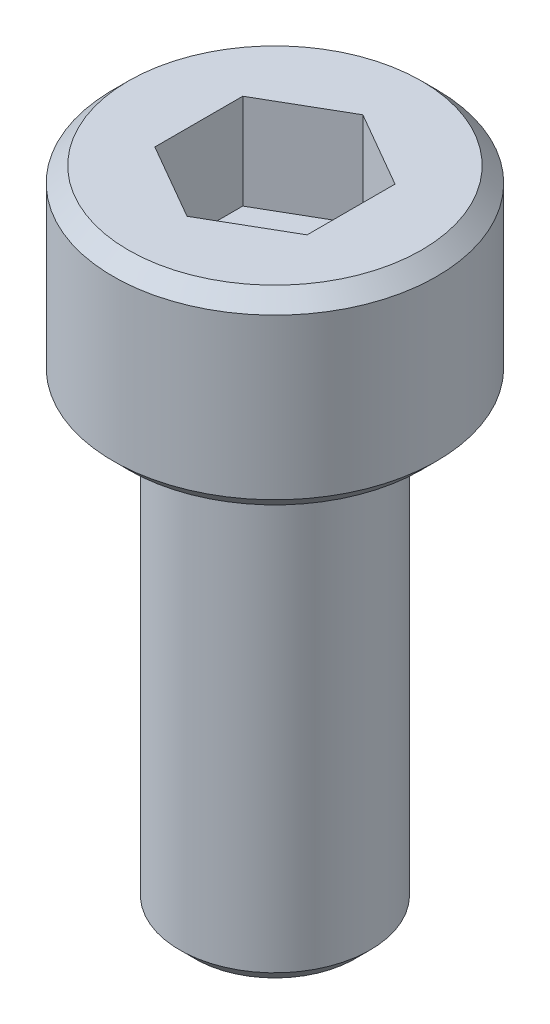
ISO-10303-21;
HEADER;
FILE_DESCRIPTION(('STEP AP214'),'2;1');
FILE_NAME('part.step','',(''),(''),'','','');
FILE_SCHEMA(('AUTOMOTIVE_DESIGN { 1 0 10303 214 1 1 1 1 }'));
ENDSEC;
DATA;
#1=APPLICATION_CONTEXT('core data for automotive mechanical design processes');
#2=APPLICATION_PROTOCOL_DEFINITION('international standard','automotive_design',2000,#1);
#3=PRODUCT_CONTEXT('',#1,'mechanical');
#4=PRODUCT('Part','Part','',(#3));
#5=PRODUCT_RELATED_PRODUCT_CATEGORY('part','',(#4));
#6=PRODUCT_DEFINITION_FORMATION('','',#4);
#7=PRODUCT_DEFINITION_CONTEXT('part definition',#1,'design');
#8=PRODUCT_DEFINITION('design','',#6,#7);
#9=PRODUCT_DEFINITION_SHAPE('','',#8);
#10=(LENGTH_UNIT() NAMED_UNIT(*) SI_UNIT(.MILLI.,.METRE.));
#11=(NAMED_UNIT(*) PLANE_ANGLE_UNIT() SI_UNIT($,.RADIAN.));
#12=(NAMED_UNIT(*) SI_UNIT($,.STERADIAN.) SOLID_ANGLE_UNIT());
#13=UNCERTAINTY_MEASURE_WITH_UNIT(LENGTH_MEASURE(1.E-05),#10,'distance_accuracy_value','');
#14=(GEOMETRIC_REPRESENTATION_CONTEXT(3) GLOBAL_UNCERTAINTY_ASSIGNED_CONTEXT((#13)) GLOBAL_UNIT_ASSIGNED_CONTEXT((#10,
#11,#12)) REPRESENTATION_CONTEXT('',''));
#15=CARTESIAN_POINT('',(0.,0.,0.));
#16=DIRECTION('',(0.,0.,1.));
#17=DIRECTION('',(1.,0.,0.));
#18=AXIS2_PLACEMENT_3D('',#15,#16,#17);
#19=CARTESIAN_POINT('',(4.25000000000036,17.0000000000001,0.));
#20=DIRECTION('',(0.,0.999999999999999,0.));
#21=DIRECTION('',(0.,0.,1.));
#22=AXIS2_PLACEMENT_3D('',#19,#20,#21);
#23=PLANE('',#22);
#24=DIRECTION('',(0.866025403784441,0.,-0.5));
#25=VECTOR('',#24,1.);
#26=CARTESIAN_POINT('',(2.22044604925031E-13,17.0000000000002,2.30940107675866));
#27=LINE('',#26,#25);
#28=CARTESIAN_POINT('',(2.22044604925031E-13,17.0000000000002,2.30940107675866));
#29=VERTEX_POINT('',#28);
#30=CARTESIAN_POINT('',(2.00000000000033,17.0000000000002,1.15470053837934));
#31=VERTEX_POINT('',#30);
#32=EDGE_CURVE('E52',#29,#31,#27,.T.);
#33=ORIENTED_EDGE('',*,*,#32,.F.);
#34=DIRECTION('',(0.866025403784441,0.,0.5));
#35=VECTOR('',#34,1.);
#36=CARTESIAN_POINT('',(-1.99999999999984,17.,1.15470053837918));
#37=LINE('',#36,#35);
#38=CARTESIAN_POINT('',(-1.99999999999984,17.,1.15470053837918));
#39=VERTEX_POINT('',#38);
#40=EDGE_CURVE('E121',#39,#29,#37,.T.);
#41=ORIENTED_EDGE('',*,*,#40,.F.);
#42=DIRECTION('',(0.,0.,1.));
#43=VECTOR('',#42,1.);
#44=CARTESIAN_POINT('',(-1.99999999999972,17.0000000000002,-1.15470053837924));
#45=LINE('',#44,#43);
#46=CARTESIAN_POINT('',(-1.99999999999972,17.0000000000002,-1.15470053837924));
#47=VERTEX_POINT('',#46);
#48=EDGE_CURVE('E115',#47,#39,#45,.T.);
#49=ORIENTED_EDGE('',*,*,#48,.F.);
#50=DIRECTION('',(-0.866025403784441,0.,0.5));
#51=VECTOR('',#50,1.);
#52=CARTESIAN_POINT('',(1.66533453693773E-13,17.0000000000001,-2.30940107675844));
#53=LINE('',#52,#51);
#54=CARTESIAN_POINT('',(1.66533453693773E-13,17.0000000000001,-2.30940107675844));
#55=VERTEX_POINT('',#54);
#56=EDGE_CURVE('E113',#55,#47,#53,.T.);
#57=ORIENTED_EDGE('',*,*,#56,.F.);
#58=DIRECTION('',(-0.866025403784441,0.,-0.5));
#59=VECTOR('',#58,1.);
#60=CARTESIAN_POINT('',(2.00000000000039,17.0000000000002,-1.15470053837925));
#61=LINE('',#60,#59);
#62=CARTESIAN_POINT('',(2.00000000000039,17.0000000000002,-1.15470053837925));
#63=VERTEX_POINT('',#62);
#64=EDGE_CURVE('E95',#63,#55,#61,.T.);
#65=ORIENTED_EDGE('',*,*,#64,.F.);
#66=DIRECTION('',(0.,0.,-1.));
#67=VECTOR('',#66,1.);
#68=CARTESIAN_POINT('',(2.00000000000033,17.0000000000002,1.15470053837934));
#69=LINE('',#68,#67);
#70=EDGE_CURVE('E106',#31,#63,#69,.T.);
#71=ORIENTED_EDGE('',*,*,#70,.F.);
#72=EDGE_LOOP('',(#33,#41,#49,#57,#65,#71));
#73=FACE_BOUND('',#72,.T.);
#74=CARTESIAN_POINT('',(1.66533453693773E-13,17.0000000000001,0.));
#75=DIRECTION('',(0.,0.999999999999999,0.));
#76=DIRECTION('',(0.,0.,1.));
#77=AXIS2_PLACEMENT_3D('',#74,#75,#76);
#78=CIRCLE('',#77,3.85);
#79=CARTESIAN_POINT('',(3.33752470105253E-13,17.0000000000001,-3.85000000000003));
#80=VERTEX_POINT('',#79);
#81=EDGE_CURVE('E154',#80,#80,#78,.T.);
#82=ORIENTED_EDGE('',*,*,#81,.T.);
#83=EDGE_LOOP('',(#82));
#84=FACE_BOUND('',#83,.T.);
#85=ADVANCED_FACE('F38',(#73,#84),#23,.T.);
#86=CARTESIAN_POINT('',(2.77555756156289E-13,1.11022302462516E-13,1.38777878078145E-13));
#87=DIRECTION('',(0.,-0.999999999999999,0.));
#88=DIRECTION('',(0.,0.,-1.));
#89=AXIS2_PLACEMENT_3D('',#86,#87,#88);
#90=CYLINDRICAL_SURFACE('',#89,4.25);
#91=CARTESIAN_POINT('',(3.33066907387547E-13,16.6000000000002,0.));
#92=DIRECTION('',(0.,0.999999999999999,0.));
#93=DIRECTION('',(0.,0.,1.));
#94=AXIS2_PLACEMENT_3D('',#91,#92,#93);
#95=CIRCLE('',#94,4.25);
#96=CARTESIAN_POINT('',(2.80106493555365E-13,16.6000000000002,-4.24999999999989));
#97=VERTEX_POINT('',#96);
#98=EDGE_CURVE('E151',#97,#97,#95,.F.);
#99=CARTESIAN_POINT('',(2.22044604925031E-13,12.4000000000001,0.));
#100=DIRECTION('',(0.,-0.999999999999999,0.));
#101=DIRECTION('',(0.,0.,-1.));
#102=AXIS2_PLACEMENT_3D('',#99,#100,#101);
#103=CIRCLE('',#102,4.25);
#104=CARTESIAN_POINT('',(2.79640199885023E-13,12.4000000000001,-4.24999999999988));
#105=VERTEX_POINT('',#104);
#106=EDGE_CURVE('E148',#105,#105,#103,.F.);
#107=CARTESIAN_POINT('',(2.80106493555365E-13,16.6000000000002,-4.24999999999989));
#108=CARTESIAN_POINT('',(2.80101636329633E-13,16.5562500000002,-4.24999999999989));
#109=CARTESIAN_POINT('',(2.800967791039E-13,16.5125000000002,-4.24999999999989));
#110=CARTESIAN_POINT('',(2.80087064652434E-13,16.4250000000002,-4.24999999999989));
#111=CARTESIAN_POINT('',(2.80082207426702E-13,16.3812500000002,-4.24999999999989));
#112=CARTESIAN_POINT('',(2.80072492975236E-13,16.2937500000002,-4.24999999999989));
#113=CARTESIAN_POINT('',(2.80067635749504E-13,16.2500000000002,-4.24999999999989));
#114=CARTESIAN_POINT('',(2.80057921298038E-13,16.1625000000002,-4.24999999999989));
#115=CARTESIAN_POINT('',(2.80053064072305E-13,16.1187500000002,-4.24999999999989));
#116=CARTESIAN_POINT('',(2.8004334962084E-13,16.0312500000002,-4.24999999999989));
#117=CARTESIAN_POINT('',(2.80038492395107E-13,15.9875000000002,-4.24999999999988));
#118=CARTESIAN_POINT('',(2.80028777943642E-13,15.9000000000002,-4.24999999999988));
#119=CARTESIAN_POINT('',(2.80023920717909E-13,15.8562500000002,-4.24999999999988));
#120=CARTESIAN_POINT('',(2.80014206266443E-13,15.7687500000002,-4.24999999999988));
#121=CARTESIAN_POINT('',(2.80009349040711E-13,15.7250000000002,-4.24999999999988));
#122=CARTESIAN_POINT('',(2.79999634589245E-13,15.6375000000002,-4.24999999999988));
#123=CARTESIAN_POINT('',(2.79994777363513E-13,15.5937500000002,-4.24999999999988));
#124=CARTESIAN_POINT('',(2.79985062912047E-13,15.5062500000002,-4.24999999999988));
#125=CARTESIAN_POINT('',(2.79980205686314E-13,15.4625000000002,-4.24999999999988));
#126=CARTESIAN_POINT('',(2.79970491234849E-13,15.3750000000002,-4.24999999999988));
#127=CARTESIAN_POINT('',(2.79965634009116E-13,15.3312500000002,-4.24999999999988));
#128=CARTESIAN_POINT('',(2.79955919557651E-13,15.2437500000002,-4.24999999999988));
#129=CARTESIAN_POINT('',(2.79951062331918E-13,15.2000000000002,-4.24999999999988));
#130=CARTESIAN_POINT('',(2.79941347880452E-13,15.1125000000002,-4.24999999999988));
#131=CARTESIAN_POINT('',(2.7993649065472E-13,15.0687500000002,-4.24999999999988));
#132=CARTESIAN_POINT('',(2.79926776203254E-13,14.9812500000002,-4.24999999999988));
#133=CARTESIAN_POINT('',(2.79921918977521E-13,14.9375000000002,-4.24999999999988));
#134=CARTESIAN_POINT('',(2.79912204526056E-13,14.8500000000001,-4.24999999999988));
#135=CARTESIAN_POINT('',(2.79907347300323E-13,14.8062500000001,-4.24999999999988));
#136=CARTESIAN_POINT('',(2.79897632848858E-13,14.7187500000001,-4.24999999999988));
#137=CARTESIAN_POINT('',(2.79892775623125E-13,14.6750000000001,-4.24999999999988));
#138=CARTESIAN_POINT('',(2.7988306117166E-13,14.5875000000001,-4.24999999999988));
#139=CARTESIAN_POINT('',(2.79878203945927E-13,14.5437500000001,-4.24999999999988));
#140=CARTESIAN_POINT('',(2.79868489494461E-13,14.4562500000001,-4.24999999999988));
#141=CARTESIAN_POINT('',(2.79863632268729E-13,14.4125000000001,-4.24999999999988));
#142=CARTESIAN_POINT('',(2.79853917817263E-13,14.3250000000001,-4.24999999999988));
#143=CARTESIAN_POINT('',(2.7984906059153E-13,14.2812500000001,-4.24999999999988));
#144=CARTESIAN_POINT('',(2.79839346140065E-13,14.1937500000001,-4.24999999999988));
#145=CARTESIAN_POINT('',(2.79834488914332E-13,14.1500000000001,-4.24999999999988));
#146=CARTESIAN_POINT('',(2.79824774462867E-13,14.0625000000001,-4.24999999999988));
#147=CARTESIAN_POINT('',(2.79819917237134E-13,14.0187500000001,-4.24999999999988));
#148=CARTESIAN_POINT('',(2.79810202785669E-13,13.9312500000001,-4.24999999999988));
#149=CARTESIAN_POINT('',(2.79805345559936E-13,13.8875000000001,-4.24999999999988));
#150=CARTESIAN_POINT('',(2.7979563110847E-13,13.8000000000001,-4.24999999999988));
#151=CARTESIAN_POINT('',(2.79790773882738E-13,13.7562500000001,-4.24999999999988));
#152=CARTESIAN_POINT('',(2.79781059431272E-13,13.6687500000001,-4.24999999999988));
#153=CARTESIAN_POINT('',(2.79776202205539E-13,13.6250000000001,-4.24999999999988));
#154=CARTESIAN_POINT('',(2.79766487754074E-13,13.5375000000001,-4.24999999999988));
#155=CARTESIAN_POINT('',(2.79761630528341E-13,13.4937500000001,-4.24999999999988));
#156=CARTESIAN_POINT('',(2.79751916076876E-13,13.4062500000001,-4.24999999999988));
#157=CARTESIAN_POINT('',(2.79747058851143E-13,13.3625000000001,-4.24999999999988));
#158=CARTESIAN_POINT('',(2.79737344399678E-13,13.2750000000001,-4.24999999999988));
#159=CARTESIAN_POINT('',(2.79732487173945E-13,13.2312500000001,-4.24999999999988));
#160=CARTESIAN_POINT('',(2.79722772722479E-13,13.1437500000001,-4.24999999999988));
#161=CARTESIAN_POINT('',(2.79717915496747E-13,13.1000000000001,-4.24999999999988));
#162=CARTESIAN_POINT('',(2.79708201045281E-13,13.0125000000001,-4.24999999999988));
#163=CARTESIAN_POINT('',(2.79703343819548E-13,12.9687500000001,-4.24999999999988));
#164=CARTESIAN_POINT('',(2.79693629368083E-13,12.8812500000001,-4.24999999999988));
#165=CARTESIAN_POINT('',(2.7968877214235E-13,12.8375000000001,-4.24999999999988));
#166=CARTESIAN_POINT('',(2.79679057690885E-13,12.7500000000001,-4.24999999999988));
#167=CARTESIAN_POINT('',(2.79674200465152E-13,12.7062500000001,-4.24999999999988));
#168=CARTESIAN_POINT('',(2.79664486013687E-13,12.6187500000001,-4.24999999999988));
#169=CARTESIAN_POINT('',(2.79659628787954E-13,12.5750000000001,-4.24999999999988));
#170=CARTESIAN_POINT('',(2.79649914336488E-13,12.4875000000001,-4.24999999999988));
#171=CARTESIAN_POINT('',(2.79645057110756E-13,12.4437500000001,-4.24999999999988));
#172=CARTESIAN_POINT('',(2.79640199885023E-13,12.4000000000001,-4.24999999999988));
#173=B_SPLINE_CURVE_WITH_KNOTS('',3,(#107,#108,#109,#110,#111,#112,#113,#114,#115,#116,#117,
#118,#119,#120,#121,#122,#123,#124,#125,#126,#127,#128,#129,#130,#131,#132,#133,#134,#135,#136,
#137,#138,#139,#140,#141,#142,#143,#144,#145,#146,#147,#148,#149,#150,#151,#152,#153,#154,#155,
#156,#157,#158,#159,#160,#161,#162,#163,#164,#165,#166,#167,#168,#169,#170,#171,#172),
.UNSPECIFIED.,.F.,.F.,(4,2,2,2,2,2,2,2,2,2,2,2,2,2,2,2,2,2,2,2,2,2,2,2,2,2,2,2,2,2,2,2,4),(0.,
0.131250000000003,0.262500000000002,0.393750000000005,0.525000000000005,0.656250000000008,
0.787500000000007,0.91875000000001,1.05000000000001,1.18125000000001,1.31250000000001,
1.44375000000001,1.57500000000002,1.70625000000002,1.83750000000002,1.96875000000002,
2.10000000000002,2.23125000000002,2.36250000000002,2.49375000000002,2.62500000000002,
2.75625000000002,2.88750000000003,3.01875000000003,3.15000000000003,3.28125000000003,
3.41250000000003,3.54375000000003,3.67500000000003,3.80625000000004,3.93750000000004,
4.06875000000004,4.20000000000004),.UNSPECIFIED.);
#174=EDGE_CURVE('BSEAM181',#97,#105,#173,.T.);
#175=ORIENTED_EDGE('',*,*,#98,.T.);
#176=ORIENTED_EDGE('',*,*,#106,.T.);
#177=ORIENTED_EDGE('',*,*,#174,.T.);
#178=ORIENTED_EDGE('',*,*,#174,.F.);
#179=EDGE_LOOP('',(#175,#177,#176,#178));
#180=FACE_BOUND('',#179,.T.);
#181=ADVANCED_FACE('F181',(#180),#90,.T.);
#182=CARTESIAN_POINT('',(2.50000000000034,12.0000000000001,2.08166817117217E-13));
#183=DIRECTION('',(0.,-0.999999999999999,0.));
#184=DIRECTION('',(0.,0.,-1.));
#185=AXIS2_PLACEMENT_3D('',#182,#183,#184);
#186=PLANE('',#185);
#187=CARTESIAN_POINT('',(2.22044604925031E-13,12.0000000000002,0.));
#188=DIRECTION('',(0.,-0.999999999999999,0.));
#189=DIRECTION('',(0.,0.,-1.));
#190=AXIS2_PLACEMENT_3D('',#187,#188,#189);
#191=CIRCLE('',#190,3.85);
#192=CARTESIAN_POINT('',(2.22685758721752E-13,12.0000000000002,-3.85000000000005));
#193=VERTEX_POINT('',#192);
#194=EDGE_CURVE('E157',#193,#193,#191,.T.);
#195=ORIENTED_EDGE('',*,*,#194,.T.);
#196=EDGE_LOOP('',(#195));
#197=FACE_BOUND('',#196,.T.);
#198=CARTESIAN_POINT('',(2.22044604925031E-13,12.0000000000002,0.));
#199=DIRECTION('',(0.,-0.999999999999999,0.));
#200=DIRECTION('',(0.,0.,-1.));
#201=AXIS2_PLACEMENT_3D('',#198,#199,#200);
#202=CIRCLE('',#201,2.5);
#203=CARTESIAN_POINT('',(2.79304357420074E-13,12.0000000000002,-2.49999999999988));
#204=VERTEX_POINT('',#203);
#205=EDGE_CURVE('E139',#204,#204,#202,.T.);
#206=ORIENTED_EDGE('',*,*,#205,.F.);
#207=EDGE_LOOP('',(#206));
#208=FACE_BOUND('',#207,.T.);
#209=ADVANCED_FACE('F185',(#197,#208),#186,.T.);
#210=CARTESIAN_POINT('',(2.77555756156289E-13,1.11022302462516E-13,1.38777878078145E-13));
#211=DIRECTION('',(0.,-0.999999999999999,0.));
#212=DIRECTION('',(0.,0.,-1.));
#213=AXIS2_PLACEMENT_3D('',#210,#211,#212);
#214=CYLINDRICAL_SURFACE('',#213,2.5);
#215=CARTESIAN_POINT('',(2.22044604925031E-13,0.400000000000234,0.));
#216=DIRECTION('',(0.,-0.999999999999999,0.));
#217=DIRECTION('',(0.,0.,-1.));
#218=AXIS2_PLACEMENT_3D('',#215,#216,#217);
#219=CIRCLE('',#218,2.5);
#220=CARTESIAN_POINT('',(2.78016498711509E-13,0.400000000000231,-2.49999999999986));
#221=VERTEX_POINT('',#220);
#222=EDGE_CURVE('E11',#221,#221,#219,.F.);
#223=CARTESIAN_POINT('',(2.78016498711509E-13,0.400000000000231,-2.49999999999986));
#224=CARTESIAN_POINT('',(2.78029913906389E-13,0.520833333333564,-2.49999999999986));
#225=CARTESIAN_POINT('',(2.7804332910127E-13,0.641666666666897,-2.49999999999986));
#226=CARTESIAN_POINT('',(2.78070159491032E-13,0.883333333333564,-2.49999999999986));
#227=CARTESIAN_POINT('',(2.78083574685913E-13,1.0041666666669,-2.49999999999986));
#228=CARTESIAN_POINT('',(2.78110405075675E-13,1.24583333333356,-2.49999999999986));
#229=CARTESIAN_POINT('',(2.78123820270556E-13,1.3666666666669,-2.49999999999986));
#230=CARTESIAN_POINT('',(2.78150650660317E-13,1.60833333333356,-2.49999999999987));
#231=CARTESIAN_POINT('',(2.78164065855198E-13,1.7291666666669,-2.49999999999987));
#232=CARTESIAN_POINT('',(2.7819089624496E-13,1.97083333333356,-2.49999999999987));
#233=CARTESIAN_POINT('',(2.78204311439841E-13,2.0916666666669,-2.49999999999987));
#234=CARTESIAN_POINT('',(2.78231141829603E-13,2.33333333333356,-2.49999999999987));
#235=CARTESIAN_POINT('',(2.78244557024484E-13,2.4541666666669,-2.49999999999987));
#236=CARTESIAN_POINT('',(2.78271387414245E-13,2.69583333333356,-2.49999999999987));
#237=CARTESIAN_POINT('',(2.78284802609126E-13,2.8166666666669,-2.49999999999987));
#238=CARTESIAN_POINT('',(2.78311632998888E-13,3.05833333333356,-2.49999999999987));
#239=CARTESIAN_POINT('',(2.78325048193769E-13,3.1791666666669,-2.49999999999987));
#240=CARTESIAN_POINT('',(2.78351878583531E-13,3.42083333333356,-2.49999999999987));
#241=CARTESIAN_POINT('',(2.78365293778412E-13,3.5416666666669,-2.49999999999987));
#242=CARTESIAN_POINT('',(2.78392124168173E-13,3.78333333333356,-2.49999999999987));
#243=CARTESIAN_POINT('',(2.78405539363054E-13,3.9041666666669,-2.49999999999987));
#244=CARTESIAN_POINT('',(2.78432369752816E-13,4.14583333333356,-2.49999999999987));
#245=CARTESIAN_POINT('',(2.78445784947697E-13,4.2666666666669,-2.49999999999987));
#246=CARTESIAN_POINT('',(2.78472615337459E-13,4.50833333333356,-2.49999999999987));
#247=CARTESIAN_POINT('',(2.7848603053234E-13,4.6291666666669,-2.49999999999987));
#248=CARTESIAN_POINT('',(2.78512860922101E-13,4.87083333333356,-2.49999999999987));
#249=CARTESIAN_POINT('',(2.78526276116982E-13,4.9916666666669,-2.49999999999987));
#250=CARTESIAN_POINT('',(2.78553106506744E-13,5.23333333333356,-2.49999999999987));
#251=CARTESIAN_POINT('',(2.78566521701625E-13,5.3541666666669,-2.49999999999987));
#252=CARTESIAN_POINT('',(2.78593352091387E-13,5.59583333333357,-2.49999999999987));
#253=CARTESIAN_POINT('',(2.78606767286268E-13,5.7166666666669,-2.49999999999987));
#254=CARTESIAN_POINT('',(2.78633597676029E-13,5.95833333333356,-2.49999999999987));
#255=CARTESIAN_POINT('',(2.7864701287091E-13,6.0791666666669,-2.49999999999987));
#256=CARTESIAN_POINT('',(2.78673843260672E-13,6.32083333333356,-2.49999999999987));
#257=CARTESIAN_POINT('',(2.78687258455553E-13,6.4416666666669,-2.49999999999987));
#258=CARTESIAN_POINT('',(2.78714088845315E-13,6.68333333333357,-2.49999999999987));
#259=CARTESIAN_POINT('',(2.78727504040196E-13,6.8041666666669,-2.49999999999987));
#260=CARTESIAN_POINT('',(2.78754334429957E-13,7.04583333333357,-2.49999999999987));
#261=CARTESIAN_POINT('',(2.78767749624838E-13,7.1666666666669,-2.49999999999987));
#262=CARTESIAN_POINT('',(2.787945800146E-13,7.40833333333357,-2.49999999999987));
#263=CARTESIAN_POINT('',(2.78807995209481E-13,7.5291666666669,-2.49999999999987));
#264=CARTESIAN_POINT('',(2.78834825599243E-13,7.77083333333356,-2.49999999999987));
#265=CARTESIAN_POINT('',(2.78848240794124E-13,7.8916666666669,-2.49999999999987));
#266=CARTESIAN_POINT('',(2.78875071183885E-13,8.13333333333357,-2.49999999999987));
#267=CARTESIAN_POINT('',(2.78888486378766E-13,8.2541666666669,-2.49999999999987));
#268=CARTESIAN_POINT('',(2.78915316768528E-13,8.49583333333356,-2.49999999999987));
#269=CARTESIAN_POINT('',(2.78928731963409E-13,8.6166666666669,-2.49999999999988));
#270=CARTESIAN_POINT('',(2.78955562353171E-13,8.85833333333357,-2.49999999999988));
#271=CARTESIAN_POINT('',(2.78968977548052E-13,8.9791666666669,-2.49999999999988));
#272=CARTESIAN_POINT('',(2.78995807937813E-13,9.22083333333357,-2.49999999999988));
#273=CARTESIAN_POINT('',(2.79009223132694E-13,9.3416666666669,-2.49999999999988));
#274=CARTESIAN_POINT('',(2.79036053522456E-13,9.58333333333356,-2.49999999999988));
#275=CARTESIAN_POINT('',(2.79049468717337E-13,9.7041666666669,-2.49999999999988));
#276=CARTESIAN_POINT('',(2.79076299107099E-13,9.94583333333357,-2.49999999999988));
#277=CARTESIAN_POINT('',(2.7908971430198E-13,10.0666666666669,-2.49999999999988));
#278=CARTESIAN_POINT('',(2.79116544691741E-13,10.3083333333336,-2.49999999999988));
#279=CARTESIAN_POINT('',(2.79129959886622E-13,10.4291666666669,-2.49999999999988));
#280=CARTESIAN_POINT('',(2.79156790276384E-13,10.6708333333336,-2.49999999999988));
#281=CARTESIAN_POINT('',(2.79170205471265E-13,10.7916666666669,-2.49999999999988));
#282=CARTESIAN_POINT('',(2.79197035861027E-13,11.0333333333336,-2.49999999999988));
#283=CARTESIAN_POINT('',(2.79210451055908E-13,11.1541666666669,-2.49999999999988));
#284=CARTESIAN_POINT('',(2.79237281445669E-13,11.3958333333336,-2.49999999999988));
#285=CARTESIAN_POINT('',(2.7925069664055E-13,11.5166666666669,-2.49999999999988));
#286=CARTESIAN_POINT('',(2.79277527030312E-13,11.7583333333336,-2.49999999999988));
#287=CARTESIAN_POINT('',(2.79290942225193E-13,11.8791666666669,-2.49999999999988));
#288=CARTESIAN_POINT('',(2.79304357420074E-13,12.0000000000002,-2.49999999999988));
#289=B_SPLINE_CURVE_WITH_KNOTS('',3,(#223,#224,#225,#226,#227,#228,#229,#230,#231,#232,#233,
#234,#235,#236,#237,#238,#239,#240,#241,#242,#243,#244,#245,#246,#247,#248,#249,#250,#251,#252,
#253,#254,#255,#256,#257,#258,#259,#260,#261,#262,#263,#264,#265,#266,#267,#268,#269,#270,#271,
#272,#273,#274,#275,#276,#277,#278,#279,#280,#281,#282,#283,#284,#285,#286,#287,#288),
.UNSPECIFIED.,.F.,.F.,(4,2,2,2,2,2,2,2,2,2,2,2,2,2,2,2,2,2,2,2,2,2,2,2,2,2,2,2,2,2,2,2,4),(0.,
0.3625,0.725,1.0875,1.45,1.8125,2.175,2.5375,2.9,3.2625,3.625,3.9875,4.35,4.7125,5.075,5.4375,
5.8,6.1625,6.525,6.8875,7.25,7.6125,7.975,8.3375,8.7,9.0625,9.425,9.7875,10.15,10.5125,10.875,
11.2375,11.6),.UNSPECIFIED.);
#290=EDGE_CURVE('BSEAM190',#221,#204,#289,.T.);
#291=ORIENTED_EDGE('',*,*,#222,.T.);
#292=ORIENTED_EDGE('',*,*,#205,.T.);
#293=ORIENTED_EDGE('',*,*,#290,.T.);
#294=ORIENTED_EDGE('',*,*,#290,.F.);
#295=EDGE_LOOP('',(#291,#293,#292,#294));
#296=FACE_BOUND('',#295,.T.);
#297=ADVANCED_FACE('F190',(#296),#214,.T.);
#298=CARTESIAN_POINT('',(2.77555756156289E-13,1.11022302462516E-13,1.38777878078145E-13));
#299=DIRECTION('',(0.,-0.999999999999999,0.));
#300=DIRECTION('',(0.,0.,-1.));
#301=AXIS2_PLACEMENT_3D('',#298,#299,#300);
#302=PLANE('',#301);
#303=CARTESIAN_POINT('',(2.77555756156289E-13,1.11022302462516E-13,1.38777878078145E-13));
#304=DIRECTION('',(0.,-0.999999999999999,0.));
#305=DIRECTION('',(0.,0.,-1.));
#306=AXIS2_PLACEMENT_3D('',#303,#304,#305);
#307=CIRCLE('',#306,2.1);
#308=CARTESIAN_POINT('',(2.77905476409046E-13,1.14053211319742E-13,-2.09999999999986));
#309=VERTEX_POINT('',#308);
#310=EDGE_CURVE('E45',#309,#309,#307,.T.);
#311=ORIENTED_EDGE('',*,*,#310,.T.);
#312=EDGE_LOOP('',(#311));
#313=FACE_BOUND('',#312,.T.);
#314=ADVANCED_FACE('F162',(#313),#302,.T.);
#315=CARTESIAN_POINT('',(3.33066907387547E-13,16.6000000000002,0.));
#316=DIRECTION('',(0.,-0.999999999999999,0.));
#317=DIRECTION('',(0.,0.,-1.));
#318=AXIS2_PLACEMENT_3D('',#315,#316,#317);
#319=CONICAL_SURFACE('',#318,4.25,0.785398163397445);
#320=CARTESIAN_POINT('',(3.33752470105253E-13,17.0000000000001,-3.85000000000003));
#321=CARTESIAN_POINT('',(3.33752701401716E-13,16.9958333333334,-3.8541666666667));
#322=CARTESIAN_POINT('',(3.3375293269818E-13,16.9916666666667,-3.85833333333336));
#323=CARTESIAN_POINT('',(3.33753395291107E-13,16.9833333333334,-3.8666666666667));
#324=CARTESIAN_POINT('',(3.3375362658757E-13,16.9791666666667,-3.87083333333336));
#325=CARTESIAN_POINT('',(3.33754089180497E-13,16.9708333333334,-3.87916666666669));
#326=CARTESIAN_POINT('',(3.33754320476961E-13,16.9666666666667,-3.88333333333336));
#327=CARTESIAN_POINT('',(3.33754783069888E-13,16.9583333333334,-3.89166666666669));
#328=CARTESIAN_POINT('',(3.33755014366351E-13,16.9541666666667,-3.89583333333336));
#329=CARTESIAN_POINT('',(3.33755476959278E-13,16.9458333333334,-3.90416666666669));
#330=CARTESIAN_POINT('',(3.33755708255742E-13,16.9416666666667,-3.90833333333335));
#331=CARTESIAN_POINT('',(3.33756170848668E-13,16.9333333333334,-3.91666666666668));
#332=CARTESIAN_POINT('',(3.33756402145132E-13,16.9291666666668,-3.92083333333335));
#333=CARTESIAN_POINT('',(3.33756864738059E-13,16.9208333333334,-3.92916666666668));
#334=CARTESIAN_POINT('',(3.33757096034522E-13,16.9166666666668,-3.93333333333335));
#335=CARTESIAN_POINT('',(3.33757558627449E-13,16.9083333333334,-3.94166666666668));
#336=CARTESIAN_POINT('',(3.33757789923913E-13,16.9041666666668,-3.94583333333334));
#337=CARTESIAN_POINT('',(3.3375825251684E-13,16.8958333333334,-3.95416666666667));
#338=CARTESIAN_POINT('',(3.33758483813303E-13,16.8916666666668,-3.95833333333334));
#339=CARTESIAN_POINT('',(3.3375894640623E-13,16.8833333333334,-3.96666666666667));
#340=CARTESIAN_POINT('',(3.33759177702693E-13,16.8791666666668,-3.97083333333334));
#341=CARTESIAN_POINT('',(3.3375964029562E-13,16.8708333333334,-3.97916666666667));
#342=CARTESIAN_POINT('',(3.33759871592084E-13,16.8666666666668,-3.98333333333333));
#343=CARTESIAN_POINT('',(3.33760334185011E-13,16.8583333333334,-3.99166666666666));
#344=CARTESIAN_POINT('',(3.33760565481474E-13,16.8541666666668,-3.99583333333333));
#345=CARTESIAN_POINT('',(3.33761028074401E-13,16.8458333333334,-4.00416666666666));
#346=CARTESIAN_POINT('',(3.33761259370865E-13,16.8416666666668,-4.00833333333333));
#347=CARTESIAN_POINT('',(3.33761721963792E-13,16.8333333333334,-4.01666666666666));
#348=CARTESIAN_POINT('',(3.33761953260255E-13,16.8291666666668,-4.02083333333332));
#349=CARTESIAN_POINT('',(3.33762415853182E-13,16.8208333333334,-4.02916666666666));
#350=CARTESIAN_POINT('',(3.33762647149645E-13,16.8166666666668,-4.03333333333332));
#351=CARTESIAN_POINT('',(3.33763109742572E-13,16.8083333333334,-4.04166666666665));
#352=CARTESIAN_POINT('',(3.33763341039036E-13,16.8041666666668,-4.04583333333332));
#353=CARTESIAN_POINT('',(3.33763803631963E-13,16.7958333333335,-4.05416666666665));
#354=CARTESIAN_POINT('',(3.33764034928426E-13,16.7916666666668,-4.05833333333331));
#355=CARTESIAN_POINT('',(3.33764497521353E-13,16.7833333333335,-4.06666666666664));
#356=CARTESIAN_POINT('',(3.33764728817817E-13,16.7791666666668,-4.07083333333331));
#357=CARTESIAN_POINT('',(3.33765191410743E-13,16.7708333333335,-4.07916666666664));
#358=CARTESIAN_POINT('',(3.33765422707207E-13,16.7666666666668,-4.08333333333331));
#359=CARTESIAN_POINT('',(3.33765885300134E-13,16.7583333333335,-4.09166666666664));
#360=CARTESIAN_POINT('',(3.33766116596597E-13,16.7541666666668,-4.0958333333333));
#361=CARTESIAN_POINT('',(3.33766579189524E-13,16.7458333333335,-4.10416666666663));
#362=CARTESIAN_POINT('',(3.33766810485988E-13,16.7416666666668,-4.1083333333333));
#363=CARTESIAN_POINT('',(3.33767273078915E-13,16.7333333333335,-4.11666666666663));
#364=CARTESIAN_POINT('',(3.33767504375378E-13,16.7291666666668,-4.1208333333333));
#365=CARTESIAN_POINT('',(3.33767966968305E-13,16.7208333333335,-4.12916666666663));
#366=CARTESIAN_POINT('',(3.33768198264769E-13,16.7166666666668,-4.13333333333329));
#367=CARTESIAN_POINT('',(3.33768660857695E-13,16.7083333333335,-4.14166666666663));
#368=CARTESIAN_POINT('',(3.33768892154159E-13,16.7041666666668,-4.14583333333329));
#369=CARTESIAN_POINT('',(3.33769354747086E-13,16.6958333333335,-4.15416666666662));
#370=CARTESIAN_POINT('',(3.33769586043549E-13,16.6916666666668,-4.15833333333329));
#371=CARTESIAN_POINT('',(3.33770048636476E-13,16.6833333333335,-4.16666666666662));
#372=CARTESIAN_POINT('',(3.3377027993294E-13,16.6791666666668,-4.17083333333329));
#373=CARTESIAN_POINT('',(3.33770742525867E-13,16.6708333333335,-4.17916666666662));
#374=CARTESIAN_POINT('',(3.3377097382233E-13,16.6666666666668,-4.18333333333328));
#375=CARTESIAN_POINT('',(3.33771436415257E-13,16.6583333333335,-4.19166666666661));
#376=CARTESIAN_POINT('',(3.3377166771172E-13,16.6541666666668,-4.19583333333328));
#377=CARTESIAN_POINT('',(3.33772130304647E-13,16.6458333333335,-4.20416666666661));
#378=CARTESIAN_POINT('',(3.33772361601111E-13,16.6416666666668,-4.20833333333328));
#379=CARTESIAN_POINT('',(3.33772824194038E-13,16.6333333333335,-4.21666666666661));
#380=CARTESIAN_POINT('',(3.33773055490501E-13,16.6291666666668,-4.22083333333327));
#381=CARTESIAN_POINT('',(3.33773518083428E-13,16.6208333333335,-4.2291666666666));
#382=CARTESIAN_POINT('',(3.33773749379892E-13,16.6166666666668,-4.23333333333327));
#383=CARTESIAN_POINT('',(3.33774211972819E-13,16.6083333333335,-4.2416666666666));
#384=CARTESIAN_POINT('',(3.33774443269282E-13,16.6041666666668,-4.24583333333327));
#385=CARTESIAN_POINT('',(3.33774674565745E-13,16.6000000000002,-4.24999999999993));
#386=B_SPLINE_CURVE_WITH_KNOTS('',3,(#320,#321,#322,#323,#324,#325,#326,#327,#328,#329,#330,
#331,#332,#333,#334,#335,#336,#337,#338,#339,#340,#341,#342,#343,#344,#345,#346,#347,#348,#349,
#350,#351,#352,#353,#354,#355,#356,#357,#358,#359,#360,#361,#362,#363,#364,#365,#366,#367,#368,
#369,#370,#371,#372,#373,#374,#375,#376,#377,#378,#379,#380,#381,#382,#383,#384,#385),
.UNSPECIFIED.,.F.,.F.,(4,2,2,2,2,2,2,2,2,2,2,2,2,2,2,2,2,2,2,2,2,2,2,2,2,2,2,2,2,2,2,2,4),(0.,
0.0176776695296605,0.0353553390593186,0.0530330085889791,0.0707106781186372,0.0883883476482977,
0.106066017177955,0.123743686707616,0.141421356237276,0.159099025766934,0.176776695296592,
0.194454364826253,0.212132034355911,0.229809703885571,0.247487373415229,0.265165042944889,
0.282842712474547,0.300520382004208,0.318198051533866,0.335875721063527,0.353553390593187,
0.371231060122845,0.388908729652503,0.406586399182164,0.424264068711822,0.441941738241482,
0.45961940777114,0.4772970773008,0.494974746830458,0.512652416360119,0.530330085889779,
0.548007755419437,0.565685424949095),.UNSPECIFIED.);
#387=EDGE_CURVE('BSEAM176',#80,#97,#386,.T.);
#388=ORIENTED_EDGE('',*,*,#81,.F.);
#389=ORIENTED_EDGE('',*,*,#98,.F.);
#390=ORIENTED_EDGE('',*,*,#387,.T.);
#391=ORIENTED_EDGE('',*,*,#387,.F.);
#392=EDGE_LOOP('',(#388,#390,#389,#391));
#393=FACE_BOUND('',#392,.T.);
#394=ADVANCED_FACE('F176',(#393),#319,.T.);
#395=CARTESIAN_POINT('',(2.22044604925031E-13,12.0000000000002,0.));
#396=DIRECTION('',(0.,0.999999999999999,0.));
#397=DIRECTION('',(0.,0.,1.));
#398=AXIS2_PLACEMENT_3D('',#395,#396,#397);
#399=CONICAL_SURFACE('',#398,3.85,0.785398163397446);
#400=ORIENTED_EDGE('',*,*,#106,.F.);
#401=EDGE_LOOP('',(#400));
#402=FACE_BOUND('',#401,.T.);
#403=ORIENTED_EDGE('',*,*,#194,.F.);
#404=EDGE_LOOP('',(#403));
#405=FACE_BOUND('',#404,.T.);
#406=ADVANCED_FACE('F167',(#402,#405),#399,.T.);
#407=CARTESIAN_POINT('',(2.77555756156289E-13,1.11022302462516E-13,1.38777878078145E-13));
#408=DIRECTION('',(0.,0.999999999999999,0.));
#409=DIRECTION('',(0.,0.,1.));
#410=AXIS2_PLACEMENT_3D('',#407,#408,#409);
#411=CONICAL_SURFACE('',#410,2.1,0.785398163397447);
#412=ORIENTED_EDGE('',*,*,#222,.F.);
#413=EDGE_LOOP('',(#412));
#414=FACE_BOUND('',#413,.T.);
#415=ORIENTED_EDGE('',*,*,#310,.F.);
#416=EDGE_LOOP('',(#415));
#417=FACE_BOUND('',#416,.T.);
#418=ADVANCED_FACE('F164',(#414,#417),#411,.T.);
#419=CARTESIAN_POINT('',(3.88578058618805E-13,14.5,2.30940107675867));
#420=DIRECTION('',(0.500000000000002,0.,0.866025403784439));
#421=DIRECTION('',(0.866025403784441,0.,-0.5));
#422=AXIS2_PLACEMENT_3D('',#419,#420,#421);
#423=PLANE('',#422);
#424=ORIENTED_EDGE('',*,*,#32,.T.);
#425=DIRECTION('',(0.,0.999999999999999,0.));
#426=VECTOR('',#425,1.);
#427=CARTESIAN_POINT('',(2.00000000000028,14.5,1.15470053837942));
#428=LINE('',#427,#426);
#429=CARTESIAN_POINT('',(2.00000000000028,14.5,1.15470053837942));
#430=VERTEX_POINT('',#429);
#431=EDGE_CURVE('E103',#430,#31,#428,.T.);
#432=ORIENTED_EDGE('',*,*,#431,.F.);
#433=DIRECTION('',(0.866025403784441,0.,-0.5));
#434=VECTOR('',#433,1.);
#435=CARTESIAN_POINT('',(3.88578058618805E-13,14.5,2.30940107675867));
#436=LINE('',#435,#434);
#437=CARTESIAN_POINT('',(3.88578058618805E-13,14.5,2.30940107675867));
#438=VERTEX_POINT('',#437);
#439=EDGE_CURVE('E123',#438,#430,#436,.T.);
#440=ORIENTED_EDGE('',*,*,#439,.F.);
#441=DIRECTION('',(0.,0.999999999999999,0.));
#442=VECTOR('',#441,1.);
#443=CARTESIAN_POINT('',(3.88578058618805E-13,14.5,2.30940107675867));
#444=LINE('',#443,#442);
#445=EDGE_CURVE('E59',#438,#29,#444,.T.);
#446=ORIENTED_EDGE('',*,*,#445,.T.);
#447=EDGE_LOOP('',(#424,#432,#440,#446));
#448=FACE_BOUND('',#447,.T.);
#449=ADVANCED_FACE('F166',(#448),#423,.F.);
#450=CARTESIAN_POINT('',(-1.99999999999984,14.5000000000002,1.15470053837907));
#451=DIRECTION('',(-0.500000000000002,0.,0.866025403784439));
#452=DIRECTION('',(0.866025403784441,0.,0.5));
#453=AXIS2_PLACEMENT_3D('',#450,#451,#452);
#454=PLANE('',#453);
#455=ORIENTED_EDGE('',*,*,#40,.T.);
#456=ORIENTED_EDGE('',*,*,#445,.F.);
#457=DIRECTION('',(0.866025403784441,0.,0.5));
#458=VECTOR('',#457,1.);
#459=CARTESIAN_POINT('',(-1.99999999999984,14.5000000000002,1.15470053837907));
#460=LINE('',#459,#458);
#461=CARTESIAN_POINT('',(-1.99999999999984,14.5000000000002,1.15470053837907));
#462=VERTEX_POINT('',#461);
#463=EDGE_CURVE('E135',#462,#438,#460,.T.);
#464=ORIENTED_EDGE('',*,*,#463,.F.);
#465=DIRECTION('',(0.,0.999999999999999,0.));
#466=VECTOR('',#465,1.);
#467=CARTESIAN_POINT('',(-1.99999999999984,14.5000000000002,1.15470053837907));
#468=LINE('',#467,#466);
#469=EDGE_CURVE('E140',#462,#39,#468,.T.);
#470=ORIENTED_EDGE('',*,*,#469,.T.);
#471=EDGE_LOOP('',(#455,#456,#464,#470));
#472=FACE_BOUND('',#471,.T.);
#473=ADVANCED_FACE('F174',(#472),#454,.F.);
#474=CARTESIAN_POINT('',(-1.99999999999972,14.5000000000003,-1.15470053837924));
#475=DIRECTION('',(-1.,0.,0.));
#476=DIRECTION('',(0.,0.,1.));
#477=AXIS2_PLACEMENT_3D('',#474,#475,#476);
#478=PLANE('',#477);
#479=ORIENTED_EDGE('',*,*,#48,.T.);
#480=ORIENTED_EDGE('',*,*,#469,.F.);
#481=DIRECTION('',(0.,0.,1.));
#482=VECTOR('',#481,1.);
#483=CARTESIAN_POINT('',(-1.99999999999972,14.5000000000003,-1.15470053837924));
#484=LINE('',#483,#482);
#485=CARTESIAN_POINT('',(-1.99999999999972,14.5000000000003,-1.15470053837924));
#486=VERTEX_POINT('',#485);
#487=EDGE_CURVE('E132',#486,#462,#484,.T.);
#488=ORIENTED_EDGE('',*,*,#487,.F.);
#489=DIRECTION('',(0.,0.999999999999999,0.));
#490=VECTOR('',#489,1.);
#491=CARTESIAN_POINT('',(-1.99999999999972,14.5000000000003,-1.15470053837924));
#492=LINE('',#491,#490);
#493=EDGE_CURVE('E142',#486,#47,#492,.T.);
#494=ORIENTED_EDGE('',*,*,#493,.T.);
#495=EDGE_LOOP('',(#479,#480,#488,#494));
#496=FACE_BOUND('',#495,.T.);
#497=ADVANCED_FACE('F232',(#496),#478,.F.);
#498=CARTESIAN_POINT('',(3.33066907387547E-13,14.5000000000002,-2.30940107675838));
#499=DIRECTION('',(-0.500000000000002,0.,-0.866025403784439));
#500=DIRECTION('',(-0.866025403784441,0.,0.5));
#501=AXIS2_PLACEMENT_3D('',#498,#499,#500);
#502=PLANE('',#501);
#503=ORIENTED_EDGE('',*,*,#56,.T.);
#504=ORIENTED_EDGE('',*,*,#493,.F.);
#505=DIRECTION('',(-0.866025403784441,0.,0.5));
#506=VECTOR('',#505,1.);
#507=CARTESIAN_POINT('',(3.33066907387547E-13,14.5000000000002,-2.30940107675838));
#508=LINE('',#507,#506);
#509=CARTESIAN_POINT('',(3.33066907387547E-13,14.5000000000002,-2.30940107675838));
#510=VERTEX_POINT('',#509);
#511=EDGE_CURVE('E129',#510,#486,#508,.T.);
#512=ORIENTED_EDGE('',*,*,#511,.F.);
#513=DIRECTION('',(0.,0.999999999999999,0.));
#514=VECTOR('',#513,1.);
#515=CARTESIAN_POINT('',(3.33066907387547E-13,14.5000000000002,-2.30940107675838));
#516=LINE('',#515,#514);
#517=EDGE_CURVE('E102',#510,#55,#516,.T.);
#518=ORIENTED_EDGE('',*,*,#517,.T.);
#519=EDGE_LOOP('',(#503,#504,#512,#518));
#520=FACE_BOUND('',#519,.T.);
#521=ADVANCED_FACE('F241',(#520),#502,.F.);
#522=CARTESIAN_POINT('',(2.00000000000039,14.5000000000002,-1.15470053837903));
#523=DIRECTION('',(0.500000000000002,0.,-0.866025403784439));
#524=DIRECTION('',(-0.866025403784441,0.,-0.500000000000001));
#525=AXIS2_PLACEMENT_3D('',#522,#523,#524);
#526=PLANE('',#525);
#527=ORIENTED_EDGE('',*,*,#64,.T.);
#528=ORIENTED_EDGE('',*,*,#517,.F.);
#529=DIRECTION('',(-0.866025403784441,0.,-0.5));
#530=VECTOR('',#529,1.);
#531=CARTESIAN_POINT('',(2.00000000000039,14.5000000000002,-1.15470053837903));
#532=LINE('',#531,#530);
#533=CARTESIAN_POINT('',(2.00000000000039,14.5000000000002,-1.15470053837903));
#534=VERTEX_POINT('',#533);
#535=EDGE_CURVE('E98',#534,#510,#532,.T.);
#536=ORIENTED_EDGE('',*,*,#535,.F.);
#537=DIRECTION('',(0.,0.999999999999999,0.));
#538=VECTOR('',#537,1.);
#539=CARTESIAN_POINT('',(2.00000000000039,14.5000000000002,-1.15470053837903));
#540=LINE('',#539,#538);
#541=EDGE_CURVE('E91',#534,#63,#540,.T.);
#542=ORIENTED_EDGE('',*,*,#541,.T.);
#543=EDGE_LOOP('',(#527,#528,#536,#542));
#544=FACE_BOUND('',#543,.T.);
#545=ADVANCED_FACE('F93',(#544),#526,.F.);
#546=CARTESIAN_POINT('',(2.00000000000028,14.5,1.15470053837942));
#547=DIRECTION('',(1.,0.,0.));
#548=DIRECTION('',(0.,0.,-1.));
#549=AXIS2_PLACEMENT_3D('',#546,#547,#548);
#550=PLANE('',#549);
#551=ORIENTED_EDGE('',*,*,#70,.T.);
#552=ORIENTED_EDGE('',*,*,#541,.F.);
#553=DIRECTION('',(0.,0.,-1.));
#554=VECTOR('',#553,1.);
#555=CARTESIAN_POINT('',(2.00000000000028,14.5,1.15470053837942));
#556=LINE('',#555,#554);
#557=EDGE_CURVE('E126',#430,#534,#556,.T.);
#558=ORIENTED_EDGE('',*,*,#557,.F.);
#559=ORIENTED_EDGE('',*,*,#431,.T.);
#560=EDGE_LOOP('',(#551,#552,#558,#559));
#561=FACE_BOUND('',#560,.T.);
#562=ADVANCED_FACE('F107',(#561),#550,.F.);
#563=CARTESIAN_POINT('',(4.00000000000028,14.5000000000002,1.2490009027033E-13));
#564=DIRECTION('',(0.,0.999999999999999,0.));
#565=DIRECTION('',(0.,0.,1.));
#566=AXIS2_PLACEMENT_3D('',#563,#564,#565);
#567=PLANE('',#566);
#568=ORIENTED_EDGE('',*,*,#439,.T.);
#569=ORIENTED_EDGE('',*,*,#557,.T.);
#570=ORIENTED_EDGE('',*,*,#535,.T.);
#571=ORIENTED_EDGE('',*,*,#511,.T.);
#572=ORIENTED_EDGE('',*,*,#487,.T.);
#573=ORIENTED_EDGE('',*,*,#463,.T.);
#574=EDGE_LOOP('',(#568,#569,#570,#571,#572,#573));
#575=FACE_BOUND('',#574,.T.);
#576=ADVANCED_FACE('F268',(#575),#567,.T.);
#577=CLOSED_SHELL('',(#85,#181,#209,#297,#314,#394,#406,#418,#449,#473,#497,#521,#545,#562,#576));
#578=MANIFOLD_SOLID_BREP('B2',#577);
#579=ADVANCED_BREP_SHAPE_REPRESENTATION('',(#18,#578),#14);
#580=SHAPE_DEFINITION_REPRESENTATION(#9,#579);
ENDSEC;
END-ISO-10303-21;
